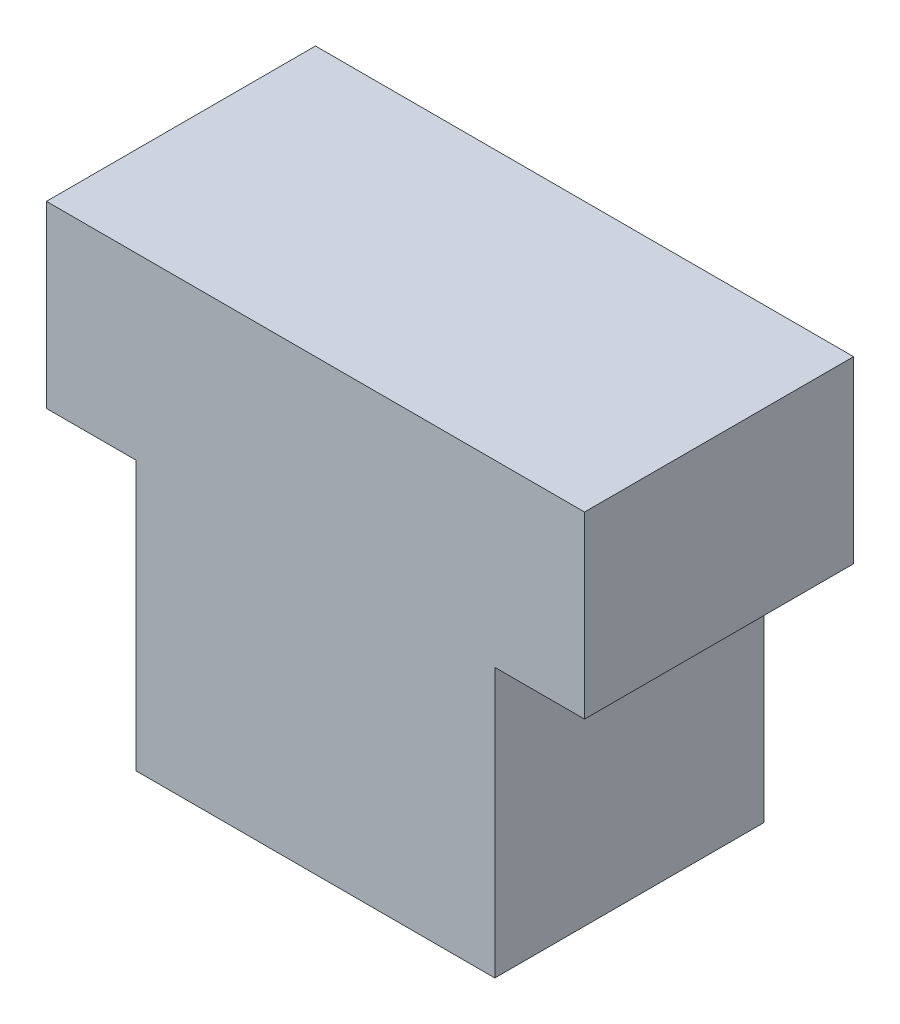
from build123d import *

# Parameters (mm, degrees)
BOSS_EXTRUDE1_DEPTH = 15


with BuildPart() as part:
    # Sketch1 → Boss-Extrude1 (new body)
    with BuildSketch(Plane.XY):
        Polygon((0, 0), (0, 15), (-5, 15), (-5, 25), (25, 25), (25, 15), (20, 15), (20, 0), align=None)
    extrude(amount=BOSS_EXTRUDE1_DEPTH)


solid = part.part
